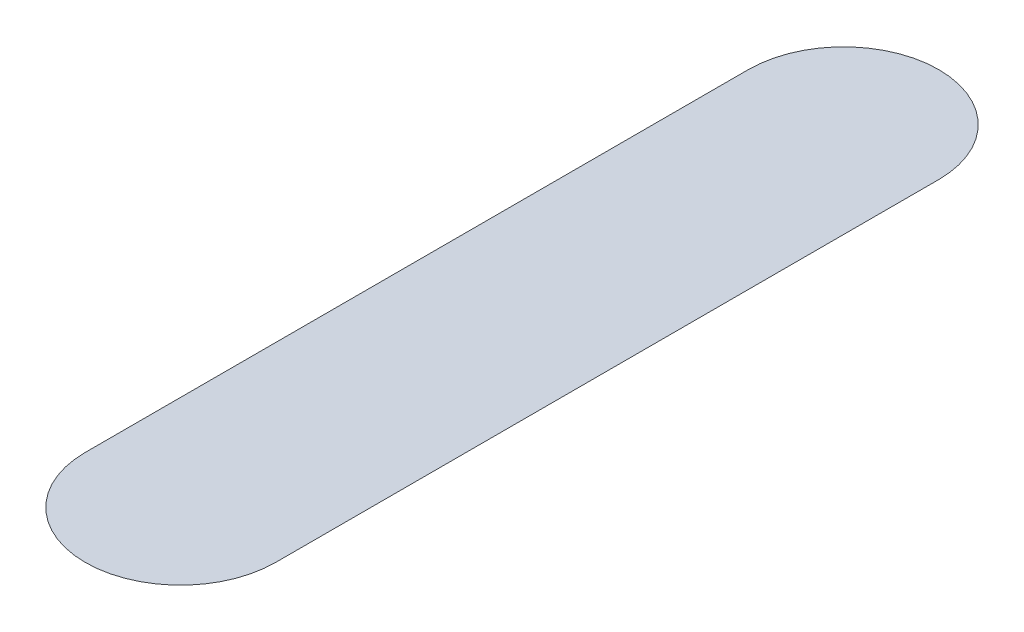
from build123d import *
from build123d.topology import SkipClean

# Parameters (mm, degrees)
SKETCH1_W           = 50
SKETCH1_H           = 5
BASE_EXTRUDE_DEPTH  = 70
BOSS_EXTRUDE1_DEPTH = 80
BOSS_REVOLVE3_ANGLE = 180
BOSS_REVOLVE4_ANGLE = 180
FILLET3_R           = 4
SKETCH3_W           = 140
SKETCH3_H           = 5
CUT_EXTRUDE1_DEPTH  = 87.168439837


with BuildPart() as part:
    # Sketch1 → Base-Extrude (new, symmetric)
    with BuildSketch(Plane.XY):
        with Locations((0, 2.5)):
            Rectangle(SKETCH1_W, SKETCH1_H)
    extrude(amount=BASE_EXTRUDE_DEPTH, both=True)

    # Sketch2 → Boss-Extrude1 (add)
    with BuildSketch(Plane.XY.offset(-40)):
        with BuildLine():
            Line((10, 0), (-10, 0))
            ThreePointArc((-10, 0), (0, -4), (10, 0))
        make_face()
    extrude(amount=BOSS_EXTRUDE1_DEPTH)

    # Sketch7 → Boss-Revolve3 (revolve)
    with SkipClean():  # the faces are left unmerged after this step: merging them gives an invalid solid
        with BuildSketch(Plane.XY.offset(40)):
            with BuildLine():
                Line((10, 0), (0, 0))
                Line((0, 0), (0, -4))
                ThreePointArc((0, -4), (5.385164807, -2.962912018), (10, 0))
            make_face()
            with BuildLine():
                Line((0, -4), (0, 0))
                Line((0, 0), (-10, 0))
                ThreePointArc((-10, 0), (-5.385164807, -2.962912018), (0, -4))
            make_face()
        revolve(axis=Axis((0, 0.997524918, 40), (0, -1, 0)), revolution_arc=BOSS_REVOLVE3_ANGLE)

    # Sketch9 → Boss-Revolve4 (revolve)
    with BuildSketch(Plane.XY.offset(-40)):
        with BuildLine():
            Line((0, 0), (0, -4))
            ThreePointArc((0, -4), (-5.385164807, -2.962912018), (-10, 0))
            Line((-10, 0), (0, 0))
        make_face()
    revolve(axis=Axis((0, 0.997524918, -40), (0, -1, 0)), revolution_arc=BOSS_REVOLVE4_ANGLE)

    # Fillet3
    fillet3_edges = [part.edges().sort_by_distance(p)[0] for p in [
        (-10, 0, 0),
        (10, 0, 0),
        (0, 0, 50),
        (0, 0, -50),
    ]]
    fillet(fillet3_edges, radius=FILLET3_R)

    # Sketch3 → Cut-Extrude1 (cut, through all)
    with BuildSketch(Plane.ZY.offset(25)):
        with Locations((0, 2.5)):
            Rectangle(SKETCH3_W, SKETCH3_H)
    extrude(amount=-CUT_EXTRUDE1_DEPTH, mode=Mode.SUBTRACT)


solid = part.part
